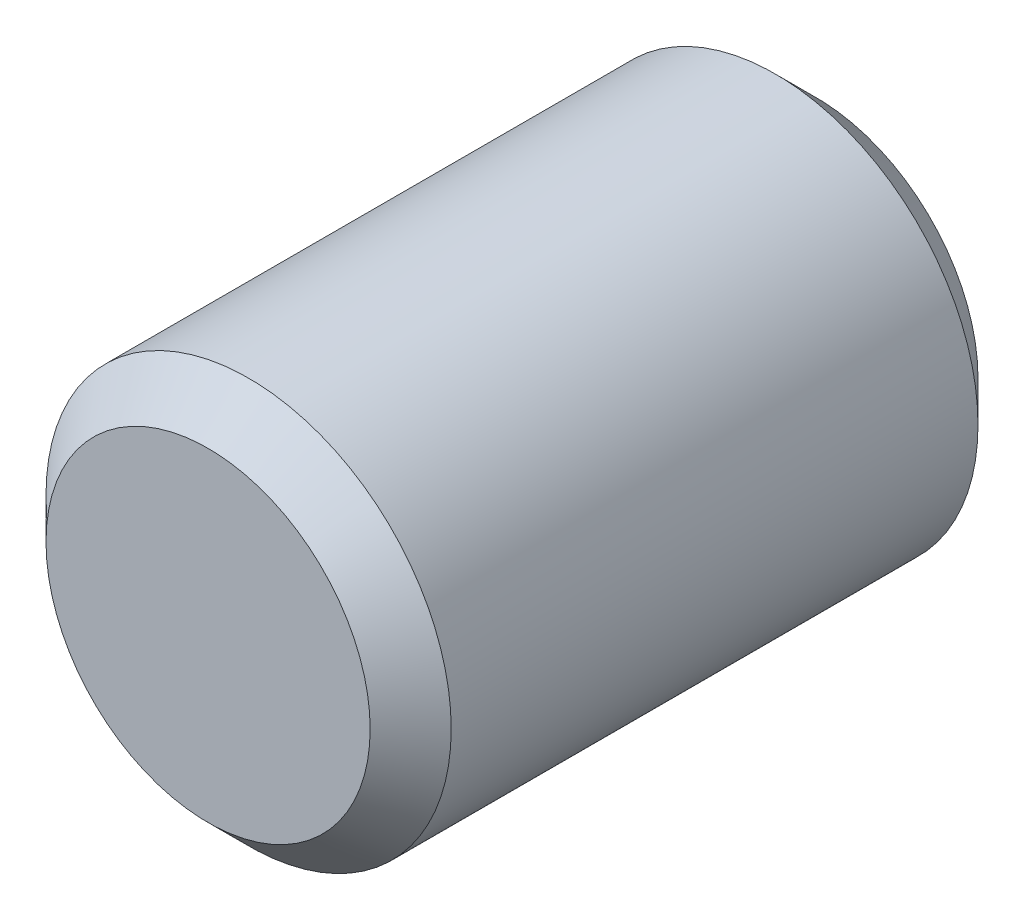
ISO-10303-21;
HEADER;
FILE_DESCRIPTION(('STEP AP214'),'2;1');
FILE_NAME('part.step','',(''),(''),'','','');
FILE_SCHEMA(('AUTOMOTIVE_DESIGN { 1 0 10303 214 1 1 1 1 }'));
ENDSEC;
DATA;
#1=APPLICATION_CONTEXT('core data for automotive mechanical design processes');
#2=APPLICATION_PROTOCOL_DEFINITION('international standard','automotive_design',2000,#1);
#3=PRODUCT_CONTEXT('',#1,'mechanical');
#4=PRODUCT('Part','Part','',(#3));
#5=PRODUCT_RELATED_PRODUCT_CATEGORY('part','',(#4));
#6=PRODUCT_DEFINITION_FORMATION('','',#4);
#7=PRODUCT_DEFINITION_CONTEXT('part definition',#1,'design');
#8=PRODUCT_DEFINITION('design','',#6,#7);
#9=PRODUCT_DEFINITION_SHAPE('','',#8);
#10=(LENGTH_UNIT() NAMED_UNIT(*) SI_UNIT(.MILLI.,.METRE.));
#11=(NAMED_UNIT(*) PLANE_ANGLE_UNIT() SI_UNIT($,.RADIAN.));
#12=(NAMED_UNIT(*) SI_UNIT($,.STERADIAN.) SOLID_ANGLE_UNIT());
#13=UNCERTAINTY_MEASURE_WITH_UNIT(LENGTH_MEASURE(1.E-05),#10,'distance_accuracy_value','');
#14=(GEOMETRIC_REPRESENTATION_CONTEXT(3) GLOBAL_UNCERTAINTY_ASSIGNED_CONTEXT((#13)) GLOBAL_UNIT_ASSIGNED_CONTEXT((#10,
#11,#12)) REPRESENTATION_CONTEXT('',''));
#15=CARTESIAN_POINT('',(0.,0.,0.));
#16=DIRECTION('',(0.,0.,1.));
#17=DIRECTION('',(1.,0.,0.));
#18=AXIS2_PLACEMENT_3D('',#15,#16,#17);
#19=CARTESIAN_POINT('',(0.,0.,15.));
#20=DIRECTION('',(0.,0.,-1.));
#21=DIRECTION('',(-1.,0.,0.));
#22=AXIS2_PLACEMENT_3D('',#19,#20,#21);
#23=CYLINDRICAL_SURFACE('',#22,5.);
#24=CARTESIAN_POINT('',(0.,0.,14.));
#25=DIRECTION('',(0.,0.,1.));
#26=DIRECTION('',(1.,0.,0.));
#27=AXIS2_PLACEMENT_3D('',#24,#25,#26);
#28=CIRCLE('',#27,5.);
#29=CARTESIAN_POINT('',(5.,0.,14.));
#30=VERTEX_POINT('',#29);
#31=EDGE_CURVE('E30',#30,#30,#28,.F.);
#32=ORIENTED_EDGE('',*,*,#31,.T.);
#33=EDGE_LOOP('',(#32));
#34=FACE_BOUND('',#33,.T.);
#35=CARTESIAN_POINT('',(0.,0.,1.));
#36=DIRECTION('',(0.,0.,1.));
#37=DIRECTION('',(1.,0.,0.));
#38=AXIS2_PLACEMENT_3D('',#35,#36,#37);
#39=CIRCLE('',#38,5.);
#40=CARTESIAN_POINT('',(5.,0.,1.));
#41=VERTEX_POINT('',#40);
#42=EDGE_CURVE('E34',#41,#41,#39,.T.);
#43=ORIENTED_EDGE('',*,*,#42,.T.);
#44=EDGE_LOOP('',(#43));
#45=FACE_BOUND('',#44,.T.);
#46=ADVANCED_FACE('F24',(#34,#45),#23,.T.);
#47=CARTESIAN_POINT('',(0.,0.,15.));
#48=DIRECTION('',(0.,0.,1.));
#49=DIRECTION('',(1.,0.,0.));
#50=AXIS2_PLACEMENT_3D('',#47,#48,#49);
#51=PLANE('',#50);
#52=CARTESIAN_POINT('',(0.,0.,15.));
#53=DIRECTION('',(0.,0.,1.));
#54=DIRECTION('',(1.,0.,0.));
#55=AXIS2_PLACEMENT_3D('',#52,#53,#54);
#56=CIRCLE('',#55,4.);
#57=CARTESIAN_POINT('',(4.,0.,15.));
#58=VERTEX_POINT('',#57);
#59=EDGE_CURVE('E38',#58,#58,#56,.T.);
#60=ORIENTED_EDGE('',*,*,#59,.T.);
#61=EDGE_LOOP('',(#60));
#62=FACE_BOUND('',#61,.T.);
#63=ADVANCED_FACE('F44',(#62),#51,.T.);
#64=CARTESIAN_POINT('',(0.,0.,0.));
#65=DIRECTION('',(0.,0.,1.));
#66=DIRECTION('',(1.,0.,0.));
#67=AXIS2_PLACEMENT_3D('',#64,#65,#66);
#68=PLANE('',#67);
#69=CARTESIAN_POINT('',(0.,0.,0.));
#70=DIRECTION('',(0.,0.,1.));
#71=DIRECTION('',(1.,0.,0.));
#72=AXIS2_PLACEMENT_3D('',#69,#70,#71);
#73=CIRCLE('',#72,4.);
#74=CARTESIAN_POINT('',(4.,0.,0.));
#75=VERTEX_POINT('',#74);
#76=EDGE_CURVE('E10',#75,#75,#73,.F.);
#77=ORIENTED_EDGE('',*,*,#76,.T.);
#78=EDGE_LOOP('',(#77));
#79=FACE_BOUND('',#78,.T.);
#80=ADVANCED_FACE('F49',(#79),#68,.F.);
#81=CARTESIAN_POINT('',(0.,0.,15.));
#82=DIRECTION('',(0.,0.,-1.));
#83=DIRECTION('',(-1.,0.,0.));
#84=AXIS2_PLACEMENT_3D('',#81,#82,#83);
#85=CONICAL_SURFACE('',#84,4.,0.785398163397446);
#86=ORIENTED_EDGE('',*,*,#31,.F.);
#87=EDGE_LOOP('',(#86));
#88=FACE_BOUND('',#87,.T.);
#89=ORIENTED_EDGE('',*,*,#59,.F.);
#90=EDGE_LOOP('',(#89));
#91=FACE_BOUND('',#90,.T.);
#92=ADVANCED_FACE('F46',(#88,#91),#85,.T.);
#93=CARTESIAN_POINT('',(0.,0.,1.));
#94=DIRECTION('',(0.,0.,1.));
#95=DIRECTION('',(1.,0.,0.));
#96=AXIS2_PLACEMENT_3D('',#93,#94,#95);
#97=CONICAL_SURFACE('',#96,5.,0.78539816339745);
#98=ORIENTED_EDGE('',*,*,#76,.F.);
#99=EDGE_LOOP('',(#98));
#100=FACE_BOUND('',#99,.T.);
#101=ORIENTED_EDGE('',*,*,#42,.F.);
#102=EDGE_LOOP('',(#101));
#103=FACE_BOUND('',#102,.T.);
#104=ADVANCED_FACE('F48',(#100,#103),#97,.T.);
#105=CLOSED_SHELL('',(#46,#63,#80,#92,#104));
#106=MANIFOLD_SOLID_BREP('B2',#105);
#107=ADVANCED_BREP_SHAPE_REPRESENTATION('',(#18,#106),#14);
#108=SHAPE_DEFINITION_REPRESENTATION(#9,#107);
ENDSEC;
END-ISO-10303-21;
